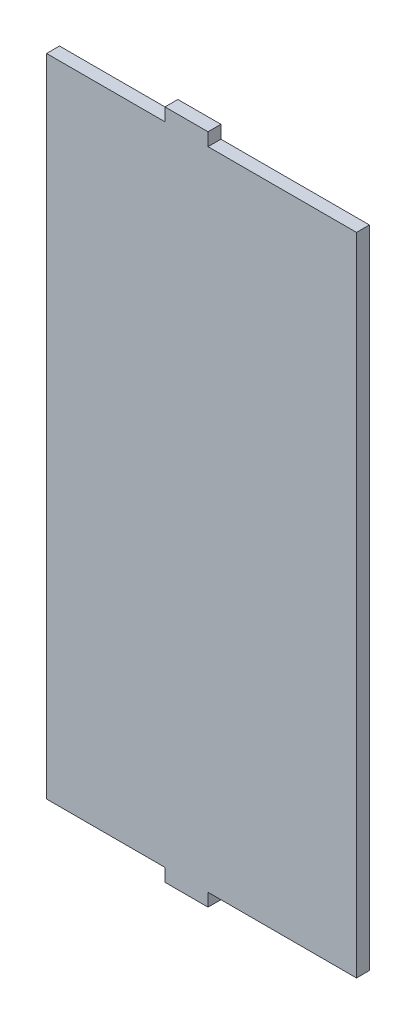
from build123d import *

# Parameters (mm, degrees)
SALIENTE_EXTRUIR1_DEPTH = 15


with BuildPart() as part:
    # Croquis1 → Saliente-Extruir1 (new body)
    with BuildSketch(Plane.XY):
        Polygon((-12.5, -375), (-12.5, -390), (37.5, -390), (37.5, -375), (210, -375), (210, 375), (37.5, 375), (37.5, 390), (-12.5, 390), (-12.5, 375), (-150, 375), (-150, -375), align=None)
    extrude(amount=SALIENTE_EXTRUIR1_DEPTH)


solid = part.part
